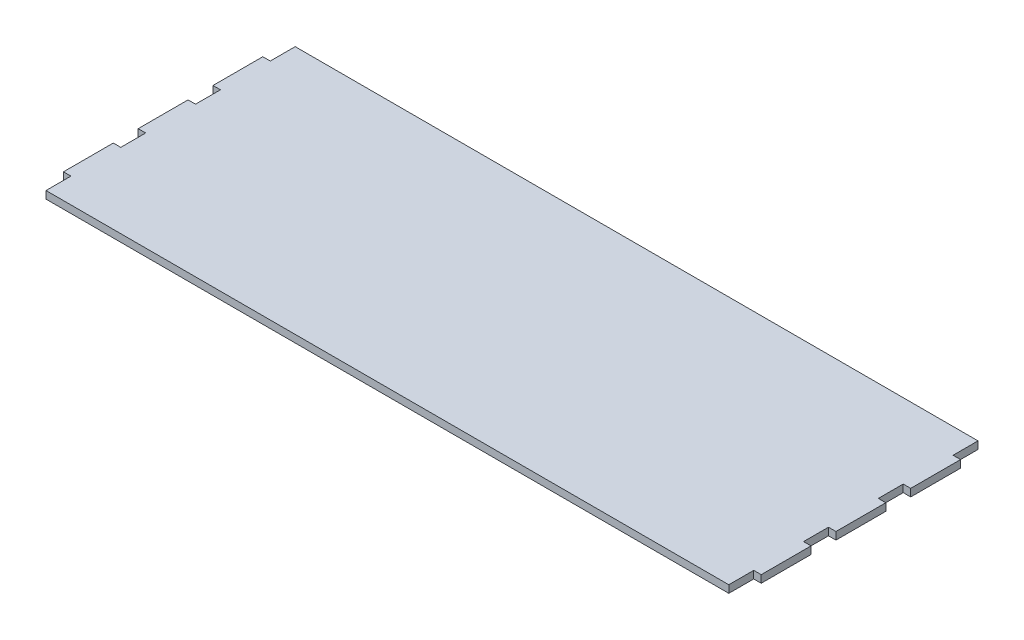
from build123d import *

# Parameters (mm, degrees)
SALIENTE_EXTRUIR1_DEPTH = 12


with BuildPart() as part:
    # Croquis1 → Saliente-Extruir1 (new body)
    with BuildSketch(Plane(origin=(0, 0, 0), x_dir=(1, 0, 0), z_dir=(0, 1, 0))):
        Polygon((-560, -40), (-560, 40), (-548, 40), (-548, 80), (-560, 80), (-560, 160), (-548, 160), (-548, 200), (548, 200), (548, 160), (560, 160), (560, 80), (548, 80), (548, 40), (560, 40), (560, -40), (548, -40), (548, -80), (560, -80), (560, -160), (548, -160), (548, -200), (-548, -200), (-548, -160), (-560, -160), (-560, -80), (-548, -80), (-548, -40), align=None)
    extrude(amount=SALIENTE_EXTRUIR1_DEPTH)


solid = part.part
